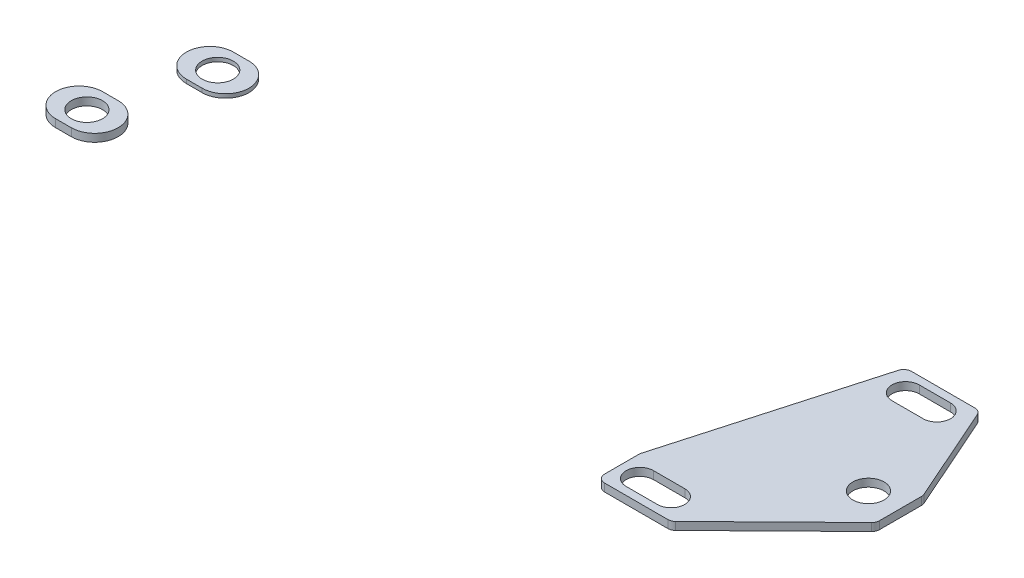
ISO-10303-21;
HEADER;
FILE_DESCRIPTION(('STEP AP214'),'2;1');
FILE_NAME('part.step','',(''),(''),'','','');
FILE_SCHEMA(('AUTOMOTIVE_DESIGN { 1 0 10303 214 1 1 1 1 }'));
ENDSEC;
DATA;
#1=APPLICATION_CONTEXT('core data for automotive mechanical design processes');
#2=APPLICATION_PROTOCOL_DEFINITION('international standard','automotive_design',2000,#1);
#3=PRODUCT_CONTEXT('',#1,'mechanical');
#4=PRODUCT('Part','Part','',(#3));
#5=PRODUCT_RELATED_PRODUCT_CATEGORY('part','',(#4));
#6=PRODUCT_DEFINITION_FORMATION('','',#4);
#7=PRODUCT_DEFINITION_CONTEXT('part definition',#1,'design');
#8=PRODUCT_DEFINITION('design','',#6,#7);
#9=PRODUCT_DEFINITION_SHAPE('','',#8);
#10=(LENGTH_UNIT() NAMED_UNIT(*) SI_UNIT(.MILLI.,.METRE.));
#11=(NAMED_UNIT(*) PLANE_ANGLE_UNIT() SI_UNIT($,.RADIAN.));
#12=(NAMED_UNIT(*) SI_UNIT($,.STERADIAN.) SOLID_ANGLE_UNIT());
#13=UNCERTAINTY_MEASURE_WITH_UNIT(LENGTH_MEASURE(1.E-05),#10,'distance_accuracy_value','');
#14=(GEOMETRIC_REPRESENTATION_CONTEXT(3) GLOBAL_UNCERTAINTY_ASSIGNED_CONTEXT((#13)) GLOBAL_UNIT_ASSIGNED_CONTEXT((#10,
#11,#12)) REPRESENTATION_CONTEXT('',''));
#15=CARTESIAN_POINT('',(0.,0.,0.));
#16=DIRECTION('',(0.,0.,1.));
#17=DIRECTION('',(1.,0.,0.));
#18=AXIS2_PLACEMENT_3D('',#15,#16,#17);
#19=CARTESIAN_POINT('',(0.,-10.,0.));
#20=DIRECTION('',(0.,-1.,0.));
#21=DIRECTION('',(0.,0.,-1.));
#22=AXIS2_PLACEMENT_3D('',#19,#20,#21);
#23=PLANE('',#22);
#24=CARTESIAN_POINT('',(83.,-10.,0.));
#25=DIRECTION('',(0.,-1.,0.));
#26=DIRECTION('',(0.,0.,-1.));
#27=AXIS2_PLACEMENT_3D('',#24,#25,#26);
#28=CIRCLE('',#27,4.00000000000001);
#29=CARTESIAN_POINT('',(83.,-10.,-4.00000000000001));
#30=VERTEX_POINT('',#29);
#31=EDGE_CURVE('E157',#30,#30,#28,.T.);
#32=ORIENTED_EDGE('',*,*,#31,.T.);
#33=EDGE_LOOP('',(#32));
#34=FACE_BOUND('',#33,.T.);
#35=DIRECTION('',(-0.713808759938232,0.,0.700340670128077));
#36=VECTOR('',#35,1.);
#37=CARTESIAN_POINT('',(47.632867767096,-10.,48.5488844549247));
#38=LINE('',#37,#36);
#39=CARTESIAN_POINT('',(90.4006813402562,-10.,6.58801076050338));
#40=VERTEX_POINT('',#39);
#41=CARTESIAN_POINT('',(65.0833898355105,-10.,31.4276175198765));
#42=VERTEX_POINT('',#41);
#43=EDGE_CURVE('E386',#40,#42,#38,.T.);
#44=ORIENTED_EDGE('',*,*,#43,.F.);
#45=CARTESIAN_POINT('',(89.,-10.,5.16039324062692));
#46=DIRECTION('',(0.,-1.,0.));
#47=DIRECTION('',(0.,0.,-1.));
#48=AXIS2_PLACEMENT_3D('',#45,#46,#47);
#49=CIRCLE('',#48,2.);
#50=CARTESIAN_POINT('',(91.,-10.,5.16039324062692));
#51=VERTEX_POINT('',#50);
#52=EDGE_CURVE('E469',#40,#51,#49,.F.);
#53=ORIENTED_EDGE('',*,*,#52,.T.);
#54=DIRECTION('',(0.,0.,1.));
#55=VECTOR('',#54,1.);
#56=CARTESIAN_POINT('',(91.,-10.,0.));
#57=LINE('',#56,#55);
#58=CARTESIAN_POINT('',(91.,-10.,-5.57743687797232));
#59=VERTEX_POINT('',#58);
#60=EDGE_CURVE('E534',#59,#51,#57,.T.);
#61=ORIENTED_EDGE('',*,*,#60,.F.);
#62=CARTESIAN_POINT('',(89.,-10.,-5.57743687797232));
#63=DIRECTION('',(0.,-1.,0.));
#64=DIRECTION('',(0.,0.,-1.));
#65=AXIS2_PLACEMENT_3D('',#62,#63,#64);
#66=CIRCLE('',#65,2.);
#67=CARTESIAN_POINT('',(90.8290706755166,-10.,-6.38644890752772));
#68=VERTEX_POINT('',#67);
#69=EDGE_CURVE('E467',#59,#68,#66,.F.);
#70=ORIENTED_EDGE('',*,*,#69,.T.);
#71=DIRECTION('',(-0.404506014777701,0.,-0.914535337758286));
#72=VECTOR('',#71,1.);
#73=CARTESIAN_POINT('',(78.3297247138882,-10.,-34.6458397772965));
#74=LINE('',#73,#72);
#75=CARTESIAN_POINT('',(80.0267831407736,-10.,-30.8090120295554));
#76=VERTEX_POINT('',#75);
#77=EDGE_CURVE('E502',#68,#76,#74,.T.);
#78=ORIENTED_EDGE('',*,*,#77,.T.);
#79=CARTESIAN_POINT('',(78.1977124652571,-10.,-30.));
#80=DIRECTION('',(0.,-1.,0.));
#81=DIRECTION('',(0.,0.,-1.));
#82=AXIS2_PLACEMENT_3D('',#79,#80,#81);
#83=CIRCLE('',#82,2.);
#84=CARTESIAN_POINT('',(78.1977124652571,-10.,-32.));
#85=VERTEX_POINT('',#84);
#86=EDGE_CURVE('E459',#76,#85,#83,.F.);
#87=ORIENTED_EDGE('',*,*,#86,.T.);
#88=DIRECTION('',(1.,0.,0.));
#89=VECTOR('',#88,1.);
#90=CARTESIAN_POINT('',(0.,-10.,-32.));
#91=LINE('',#90,#89);
#92=CARTESIAN_POINT('',(62.0125191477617,-10.,-32.));
#93=VERTEX_POINT('',#92);
#94=EDGE_CURVE('E495',#93,#85,#91,.T.);
#95=ORIENTED_EDGE('',*,*,#94,.F.);
#96=CARTESIAN_POINT('',(62.0125191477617,-10.,-30.));
#97=DIRECTION('',(0.,-1.,0.));
#98=DIRECTION('',(0.,0.,-1.));
#99=AXIS2_PLACEMENT_3D('',#96,#97,#98);
#100=CIRCLE('',#99,2.);
#101=CARTESIAN_POINT('',(60.0881070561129,-10.,-30.5446449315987));
#102=VERTEX_POINT('',#101);
#103=EDGE_CURVE('E170',#93,#102,#100,.F.);
#104=ORIENTED_EDGE('',*,*,#103,.T.);
#105=DIRECTION('',(0.272322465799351,0.,-0.962206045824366));
#106=VECTOR('',#105,1.);
#107=CARTESIAN_POINT('',(47.6283783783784,-10.,13.4797297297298));
#108=LINE('',#107,#106);
#109=CARTESIAN_POINT('',(45.5755879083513,-10.,20.7329227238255));
#110=VERTEX_POINT('',#109);
#111=EDGE_CURVE('E369',#110,#102,#108,.T.);
#112=ORIENTED_EDGE('',*,*,#111,.F.);
#113=CARTESIAN_POINT('',(47.5,-10.,21.2775676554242));
#114=DIRECTION('',(0.,-1.,0.));
#115=DIRECTION('',(0.,0.,-1.));
#116=AXIS2_PLACEMENT_3D('',#113,#114,#115);
#117=CIRCLE('',#116,2.);
#118=CARTESIAN_POINT('',(45.5,-10.,21.2775676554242));
#119=VERTEX_POINT('',#118);
#120=EDGE_CURVE('E461',#110,#119,#117,.F.);
#121=ORIENTED_EDGE('',*,*,#120,.T.);
#122=DIRECTION('',(0.,0.,1.));
#123=VECTOR('',#122,1.);
#124=CARTESIAN_POINT('',(45.5,-10.,0.));
#125=LINE('',#124,#123);
#126=CARTESIAN_POINT('',(45.5,-10.,30.));
#127=VERTEX_POINT('',#126);
#128=EDGE_CURVE('E365',#119,#127,#125,.T.);
#129=ORIENTED_EDGE('',*,*,#128,.T.);
#130=CARTESIAN_POINT('',(47.5,-10.,30.));
#131=DIRECTION('',(0.,-1.,0.));
#132=DIRECTION('',(0.,0.,-1.));
#133=AXIS2_PLACEMENT_3D('',#130,#131,#132);
#134=CIRCLE('',#133,2.);
#135=CARTESIAN_POINT('',(47.5,-10.,32.));
#136=VERTEX_POINT('',#135);
#137=EDGE_CURVE('E463',#127,#136,#134,.F.);
#138=ORIENTED_EDGE('',*,*,#137,.T.);
#139=DIRECTION('',(-1.,0.,0.));
#140=VECTOR('',#139,1.);
#141=CARTESIAN_POINT('',(0.,-10.,32.));
#142=LINE('',#141,#140);
#143=CARTESIAN_POINT('',(63.6827084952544,-10.,32.));
#144=VERTEX_POINT('',#143);
#145=EDGE_CURVE('E381',#144,#136,#142,.T.);
#146=ORIENTED_EDGE('',*,*,#145,.F.);
#147=CARTESIAN_POINT('',(63.6827084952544,-10.,30.));
#148=DIRECTION('',(0.,-1.,0.));
#149=DIRECTION('',(0.,0.,-1.));
#150=AXIS2_PLACEMENT_3D('',#147,#148,#149);
#151=CIRCLE('',#150,2.);
#152=EDGE_CURVE('E465',#144,#42,#151,.F.);
#153=ORIENTED_EDGE('',*,*,#152,.T.);
#154=EDGE_LOOP('',(#44,#53,#61,#70,#78,#87,#95,#104,#112,#121,#129,#138,#146,#153));
#155=FACE_BOUND('',#154,.T.);
#156=CARTESIAN_POINT('',(51.,-10.,26.5));
#157=DIRECTION('',(0.,-1.,0.));
#158=DIRECTION('',(0.,0.,-1.));
#159=AXIS2_PLACEMENT_3D('',#156,#157,#158);
#160=CIRCLE('',#159,3.5);
#161=CARTESIAN_POINT('',(51.,-10.,30.));
#162=VERTEX_POINT('',#161);
#163=CARTESIAN_POINT('',(51.,-10.,23.));
#164=VERTEX_POINT('',#163);
#165=EDGE_CURVE('E385',#162,#164,#160,.T.);
#166=ORIENTED_EDGE('',*,*,#165,.T.);
#167=DIRECTION('',(1.,0.,0.));
#168=VECTOR('',#167,1.);
#169=CARTESIAN_POINT('',(0.,-10.,23.));
#170=LINE('',#169,#168);
#171=CARTESIAN_POINT('',(59.,-10.,23.));
#172=VERTEX_POINT('',#171);
#173=EDGE_CURVE('E408',#164,#172,#170,.T.);
#174=ORIENTED_EDGE('',*,*,#173,.T.);
#175=CARTESIAN_POINT('',(59.,-10.,26.5));
#176=DIRECTION('',(0.,-1.,0.));
#177=DIRECTION('',(0.,0.,-1.));
#178=AXIS2_PLACEMENT_3D('',#175,#176,#177);
#179=CIRCLE('',#178,3.5);
#180=CARTESIAN_POINT('',(59.,-10.,30.));
#181=VERTEX_POINT('',#180);
#182=EDGE_CURVE('E396',#172,#181,#179,.T.);
#183=ORIENTED_EDGE('',*,*,#182,.T.);
#184=DIRECTION('',(-1.,0.,0.));
#185=VECTOR('',#184,1.);
#186=CARTESIAN_POINT('',(0.,-10.,30.));
#187=LINE('',#186,#185);
#188=EDGE_CURVE('E392',#181,#162,#187,.T.);
#189=ORIENTED_EDGE('',*,*,#188,.T.);
#190=EDGE_LOOP('',(#166,#174,#183,#189));
#191=FACE_BOUND('',#190,.T.);
#192=DIRECTION('',(-1.,0.,0.));
#193=VECTOR('',#192,1.);
#194=CARTESIAN_POINT('',(0.,-10.,-30.));
#195=LINE('',#194,#193);
#196=CARTESIAN_POINT('',(74.,-10.,-30.));
#197=VERTEX_POINT('',#196);
#198=CARTESIAN_POINT('',(66.,-10.,-30.));
#199=VERTEX_POINT('',#198);
#200=EDGE_CURVE('E404',#197,#199,#195,.T.);
#201=ORIENTED_EDGE('',*,*,#200,.F.);
#202=CARTESIAN_POINT('',(74.,-10.,-26.5));
#203=DIRECTION('',(0.,-1.,0.));
#204=DIRECTION('',(0.,0.,-1.));
#205=AXIS2_PLACEMENT_3D('',#202,#203,#204);
#206=CIRCLE('',#205,3.5);
#207=CARTESIAN_POINT('',(74.,-10.,-23.));
#208=VERTEX_POINT('',#207);
#209=EDGE_CURVE('E314',#197,#208,#206,.T.);
#210=ORIENTED_EDGE('',*,*,#209,.T.);
#211=DIRECTION('',(-1.,0.,0.));
#212=VECTOR('',#211,1.);
#213=CARTESIAN_POINT('',(0.,-10.,-23.));
#214=LINE('',#213,#212);
#215=CARTESIAN_POINT('',(66.,-10.,-23.));
#216=VERTEX_POINT('',#215);
#217=EDGE_CURVE('E410',#208,#216,#214,.T.);
#218=ORIENTED_EDGE('',*,*,#217,.T.);
#219=CARTESIAN_POINT('',(66.,-10.,-26.5));
#220=DIRECTION('',(0.,-1.,0.));
#221=DIRECTION('',(0.,0.,-1.));
#222=AXIS2_PLACEMENT_3D('',#219,#220,#221);
#223=CIRCLE('',#222,3.5);
#224=EDGE_CURVE('E407',#199,#216,#223,.F.);
#225=ORIENTED_EDGE('',*,*,#224,.F.);
#226=EDGE_LOOP('',(#201,#210,#218,#225));
#227=FACE_BOUND('',#226,.T.);
#228=ADVANCED_FACE('F153',(#34,#155,#191,#227),#23,.F.);
#229=CARTESIAN_POINT('',(89.,-10.,5.16039324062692));
#230=DIRECTION('',(0.,-1.,0.));
#231=DIRECTION('',(0.,0.,-1.));
#232=AXIS2_PLACEMENT_3D('',#229,#230,#231);
#233=CYLINDRICAL_SURFACE('',#232,2.);
#234=ORIENTED_EDGE('',*,*,#52,.F.);
#235=DIRECTION('',(0.,-1.,0.));
#236=VECTOR('',#235,1.);
#237=CARTESIAN_POINT('',(90.4006813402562,-10.,6.58801076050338));
#238=LINE('',#237,#236);
#239=CARTESIAN_POINT('',(90.4006813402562,-12.,6.58801076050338));
#240=VERTEX_POINT('',#239);
#241=EDGE_CURVE('E456',#240,#40,#238,.F.);
#242=ORIENTED_EDGE('',*,*,#241,.F.);
#243=CARTESIAN_POINT('',(89.,-12.,5.16039324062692));
#244=DIRECTION('',(0.,-1.,0.));
#245=DIRECTION('',(0.,0.,-1.));
#246=AXIS2_PLACEMENT_3D('',#243,#244,#245);
#247=CIRCLE('',#246,2.);
#248=CARTESIAN_POINT('',(91.,-12.,5.16039324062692));
#249=VERTEX_POINT('',#248);
#250=EDGE_CURVE('E451',#249,#240,#247,.T.);
#251=ORIENTED_EDGE('',*,*,#250,.F.);
#252=DIRECTION('',(0.,-1.,0.));
#253=VECTOR('',#252,1.);
#254=CARTESIAN_POINT('',(91.,-10.,5.16039324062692));
#255=LINE('',#254,#253);
#256=EDGE_CURVE('E436',#51,#249,#255,.T.);
#257=ORIENTED_EDGE('',*,*,#256,.F.);
#258=EDGE_LOOP('',(#234,#242,#251,#257));
#259=FACE_BOUND('',#258,.T.);
#260=ADVANCED_FACE('F562',(#259),#233,.T.);
#261=CARTESIAN_POINT('',(91.,-10.,0.));
#262=DIRECTION('',(1.,0.,0.));
#263=DIRECTION('',(0.,0.,-1.));
#264=AXIS2_PLACEMENT_3D('',#261,#262,#263);
#265=PLANE('',#264);
#266=ORIENTED_EDGE('',*,*,#60,.T.);
#267=ORIENTED_EDGE('',*,*,#256,.T.);
#268=DIRECTION('',(0.,0.,1.));
#269=VECTOR('',#268,1.);
#270=CARTESIAN_POINT('',(91.,-12.,0.));
#271=LINE('',#270,#269);
#272=CARTESIAN_POINT('',(91.,-12.,-5.57743687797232));
#273=VERTEX_POINT('',#272);
#274=EDGE_CURVE('E427',#273,#249,#271,.T.);
#275=ORIENTED_EDGE('',*,*,#274,.F.);
#276=DIRECTION('',(0.,-1.,0.));
#277=VECTOR('',#276,1.);
#278=CARTESIAN_POINT('',(91.,-10.,-5.57743687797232));
#279=LINE('',#278,#277);
#280=EDGE_CURVE('E415',#273,#59,#279,.F.);
#281=ORIENTED_EDGE('',*,*,#280,.T.);
#282=EDGE_LOOP('',(#266,#267,#275,#281));
#283=FACE_BOUND('',#282,.T.);
#284=ADVANCED_FACE('F560',(#283),#265,.T.);
#285=CARTESIAN_POINT('',(89.,-10.,-5.57743687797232));
#286=DIRECTION('',(0.,1.,0.));
#287=DIRECTION('',(0.,0.,1.));
#288=AXIS2_PLACEMENT_3D('',#285,#286,#287);
#289=CYLINDRICAL_SURFACE('',#288,2.);
#290=ORIENTED_EDGE('',*,*,#69,.F.);
#291=ORIENTED_EDGE('',*,*,#280,.F.);
#292=CARTESIAN_POINT('',(89.,-12.,-5.57743687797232));
#293=DIRECTION('',(0.,-1.,0.));
#294=DIRECTION('',(0.,0.,-1.));
#295=AXIS2_PLACEMENT_3D('',#292,#293,#294);
#296=CIRCLE('',#295,2.);
#297=CARTESIAN_POINT('',(90.8290706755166,-12.,-6.38644890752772));
#298=VERTEX_POINT('',#297);
#299=EDGE_CURVE('E449',#298,#273,#296,.T.);
#300=ORIENTED_EDGE('',*,*,#299,.F.);
#301=DIRECTION('',(0.,-1.,0.));
#302=VECTOR('',#301,1.);
#303=CARTESIAN_POINT('',(90.8290706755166,-12.,-6.38644890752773));
#304=LINE('',#303,#302);
#305=EDGE_CURVE('E473',#68,#298,#304,.T.);
#306=ORIENTED_EDGE('',*,*,#305,.F.);
#307=EDGE_LOOP('',(#290,#291,#300,#306));
#308=FACE_BOUND('',#307,.T.);
#309=ADVANCED_FACE('F557',(#308),#289,.T.);
#310=CARTESIAN_POINT('',(78.3297247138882,-10.,-34.6458397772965));
#311=DIRECTION('',(-0.914535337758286,0.,0.404506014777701));
#312=DIRECTION('',(0.404506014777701,0.,0.914535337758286));
#313=AXIS2_PLACEMENT_3D('',#310,#311,#312);
#314=PLANE('',#313);
#315=ORIENTED_EDGE('',*,*,#77,.F.);
#316=ORIENTED_EDGE('',*,*,#305,.T.);
#317=DIRECTION('',(-0.404506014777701,0.,-0.914535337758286));
#318=VECTOR('',#317,1.);
#319=CARTESIAN_POINT('',(78.3297247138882,-12.,-34.6458397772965));
#320=LINE('',#319,#318);
#321=CARTESIAN_POINT('',(80.0267831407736,-12.,-30.8090120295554));
#322=VERTEX_POINT('',#321);
#323=EDGE_CURVE('E424',#298,#322,#320,.T.);
#324=ORIENTED_EDGE('',*,*,#323,.T.);
#325=DIRECTION('',(0.,-1.,0.));
#326=VECTOR('',#325,1.);
#327=CARTESIAN_POINT('',(80.0267831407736,-10.,-30.8090120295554));
#328=LINE('',#327,#326);
#329=EDGE_CURVE('E471',#322,#76,#328,.F.);
#330=ORIENTED_EDGE('',*,*,#329,.T.);
#331=EDGE_LOOP('',(#315,#316,#324,#330));
#332=FACE_BOUND('',#331,.T.);
#333=ADVANCED_FACE('F555',(#332),#314,.F.);
#334=CARTESIAN_POINT('',(78.1977124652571,-10.,-30.));
#335=DIRECTION('',(0.,1.,0.));
#336=DIRECTION('',(0.,0.,1.));
#337=AXIS2_PLACEMENT_3D('',#334,#335,#336);
#338=CYLINDRICAL_SURFACE('',#337,2.);
#339=ORIENTED_EDGE('',*,*,#86,.F.);
#340=ORIENTED_EDGE('',*,*,#329,.F.);
#341=CARTESIAN_POINT('',(78.1977124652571,-12.,-30.));
#342=DIRECTION('',(0.,-1.,0.));
#343=DIRECTION('',(0.,0.,-1.));
#344=AXIS2_PLACEMENT_3D('',#341,#342,#343);
#345=CIRCLE('',#344,2.);
#346=CARTESIAN_POINT('',(78.1977124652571,-12.,-32.));
#347=VERTEX_POINT('',#346);
#348=EDGE_CURVE('E441',#347,#322,#345,.T.);
#349=ORIENTED_EDGE('',*,*,#348,.F.);
#350=DIRECTION('',(0.,-1.,0.));
#351=VECTOR('',#350,1.);
#352=CARTESIAN_POINT('',(78.1977124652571,-12.,-32.));
#353=LINE('',#352,#351);
#354=EDGE_CURVE('E14',#85,#347,#353,.T.);
#355=ORIENTED_EDGE('',*,*,#354,.F.);
#356=EDGE_LOOP('',(#339,#340,#349,#355));
#357=FACE_BOUND('',#356,.T.);
#358=ADVANCED_FACE('F553',(#357),#338,.T.);
#359=CARTESIAN_POINT('',(0.,-10.,-32.));
#360=DIRECTION('',(0.,0.,-1.));
#361=DIRECTION('',(-1.,0.,0.));
#362=AXIS2_PLACEMENT_3D('',#359,#360,#361);
#363=PLANE('',#362);
#364=ORIENTED_EDGE('',*,*,#94,.T.);
#365=ORIENTED_EDGE('',*,*,#354,.T.);
#366=DIRECTION('',(1.,0.,0.));
#367=VECTOR('',#366,1.);
#368=CARTESIAN_POINT('',(0.,-12.,-32.));
#369=LINE('',#368,#367);
#370=CARTESIAN_POINT('',(62.0125191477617,-12.,-32.));
#371=VERTEX_POINT('',#370);
#372=EDGE_CURVE('E421',#371,#347,#369,.T.);
#373=ORIENTED_EDGE('',*,*,#372,.F.);
#374=DIRECTION('',(0.,-1.,0.));
#375=VECTOR('',#374,1.);
#376=CARTESIAN_POINT('',(62.0125191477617,-10.,-32.));
#377=LINE('',#376,#375);
#378=EDGE_CURVE('E163',#371,#93,#377,.F.);
#379=ORIENTED_EDGE('',*,*,#378,.T.);
#380=EDGE_LOOP('',(#364,#365,#373,#379));
#381=FACE_BOUND('',#380,.T.);
#382=ADVANCED_FACE('F494',(#381),#363,.T.);
#383=CARTESIAN_POINT('',(62.0125191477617,-10.,-30.));
#384=DIRECTION('',(0.,-1.,0.));
#385=DIRECTION('',(0.,0.,-1.));
#386=AXIS2_PLACEMENT_3D('',#383,#384,#385);
#387=CYLINDRICAL_SURFACE('',#386,2.);
#388=ORIENTED_EDGE('',*,*,#103,.F.);
#389=ORIENTED_EDGE('',*,*,#378,.F.);
#390=CARTESIAN_POINT('',(62.0125191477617,-12.,-30.));
#391=DIRECTION('',(0.,-1.,0.));
#392=DIRECTION('',(0.,0.,-1.));
#393=AXIS2_PLACEMENT_3D('',#390,#391,#392);
#394=CIRCLE('',#393,2.);
#395=CARTESIAN_POINT('',(60.0881070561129,-12.,-30.5446449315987));
#396=VERTEX_POINT('',#395);
#397=EDGE_CURVE('E439',#396,#371,#394,.T.);
#398=ORIENTED_EDGE('',*,*,#397,.F.);
#399=DIRECTION('',(0.,-1.,0.));
#400=VECTOR('',#399,1.);
#401=CARTESIAN_POINT('',(60.0881070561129,-10.,-30.5446449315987));
#402=LINE('',#401,#400);
#403=EDGE_CURVE('E486',#102,#396,#402,.T.);
#404=ORIENTED_EDGE('',*,*,#403,.F.);
#405=EDGE_LOOP('',(#388,#389,#398,#404));
#406=FACE_BOUND('',#405,.T.);
#407=ADVANCED_FACE('F155',(#406),#387,.T.);
#408=CARTESIAN_POINT('',(47.6283783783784,-10.,13.4797297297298));
#409=DIRECTION('',(-0.962206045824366,0.,-0.272322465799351));
#410=DIRECTION('',(-0.272322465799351,0.,0.962206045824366));
#411=AXIS2_PLACEMENT_3D('',#408,#409,#410);
#412=PLANE('',#411);
#413=DIRECTION('',(0.272322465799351,0.,-0.962206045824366));
#414=VECTOR('',#413,1.);
#415=CARTESIAN_POINT('',(47.6283783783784,-12.,13.4797297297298));
#416=LINE('',#415,#414);
#417=CARTESIAN_POINT('',(45.5755879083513,-12.,20.7329227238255));
#418=VERTEX_POINT('',#417);
#419=EDGE_CURVE('E418',#418,#396,#416,.T.);
#420=ORIENTED_EDGE('',*,*,#419,.F.);
#421=DIRECTION('',(0.,-1.,0.));
#422=VECTOR('',#421,1.);
#423=CARTESIAN_POINT('',(45.5755879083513,-10.,20.7329227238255));
#424=LINE('',#423,#422);
#425=EDGE_CURVE('E177',#418,#110,#424,.F.);
#426=ORIENTED_EDGE('',*,*,#425,.T.);
#427=ORIENTED_EDGE('',*,*,#111,.T.);
#428=ORIENTED_EDGE('',*,*,#403,.T.);
#429=EDGE_LOOP('',(#420,#426,#427,#428));
#430=FACE_BOUND('',#429,.T.);
#431=ADVANCED_FACE('F504',(#430),#412,.T.);
#432=CARTESIAN_POINT('',(47.5,-10.,21.2775676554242));
#433=DIRECTION('',(0.,1.,0.));
#434=DIRECTION('',(0.,0.,1.));
#435=AXIS2_PLACEMENT_3D('',#432,#433,#434);
#436=CYLINDRICAL_SURFACE('',#435,2.);
#437=ORIENTED_EDGE('',*,*,#120,.F.);
#438=ORIENTED_EDGE('',*,*,#425,.F.);
#439=CARTESIAN_POINT('',(47.5,-12.,21.2775676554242));
#440=DIRECTION('',(0.,-1.,0.));
#441=DIRECTION('',(0.,0.,-1.));
#442=AXIS2_PLACEMENT_3D('',#439,#440,#441);
#443=CIRCLE('',#442,2.);
#444=CARTESIAN_POINT('',(45.5,-12.,21.2775676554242));
#445=VERTEX_POINT('',#444);
#446=EDGE_CURVE('E443',#445,#418,#443,.T.);
#447=ORIENTED_EDGE('',*,*,#446,.F.);
#448=DIRECTION('',(0.,-1.,0.));
#449=VECTOR('',#448,1.);
#450=CARTESIAN_POINT('',(45.5,-12.,21.2775676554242));
#451=LINE('',#450,#449);
#452=EDGE_CURVE('E481',#119,#445,#451,.T.);
#453=ORIENTED_EDGE('',*,*,#452,.F.);
#454=EDGE_LOOP('',(#437,#438,#447,#453));
#455=FACE_BOUND('',#454,.T.);
#456=ADVANCED_FACE('F510',(#455),#436,.T.);
#457=CARTESIAN_POINT('',(45.5,-10.,0.));
#458=DIRECTION('',(1.,0.,0.));
#459=DIRECTION('',(0.,0.,-1.));
#460=AXIS2_PLACEMENT_3D('',#457,#458,#459);
#461=PLANE('',#460);
#462=DIRECTION('',(0.,0.,1.));
#463=VECTOR('',#462,1.);
#464=CARTESIAN_POINT('',(45.5,-12.,0.));
#465=LINE('',#464,#463);
#466=CARTESIAN_POINT('',(45.5,-12.,30.));
#467=VERTEX_POINT('',#466);
#468=EDGE_CURVE('E344',#445,#467,#465,.T.);
#469=ORIENTED_EDGE('',*,*,#468,.T.);
#470=DIRECTION('',(0.,-1.,0.));
#471=VECTOR('',#470,1.);
#472=CARTESIAN_POINT('',(45.5,-10.,30.));
#473=LINE('',#472,#471);
#474=EDGE_CURVE('E484',#467,#127,#473,.F.);
#475=ORIENTED_EDGE('',*,*,#474,.T.);
#476=ORIENTED_EDGE('',*,*,#128,.F.);
#477=ORIENTED_EDGE('',*,*,#452,.T.);
#478=EDGE_LOOP('',(#469,#475,#476,#477));
#479=FACE_BOUND('',#478,.T.);
#480=ADVANCED_FACE('F513',(#479),#461,.F.);
#481=CARTESIAN_POINT('',(47.5,-10.,30.));
#482=DIRECTION('',(0.,1.,0.));
#483=DIRECTION('',(0.,0.,1.));
#484=AXIS2_PLACEMENT_3D('',#481,#482,#483);
#485=CYLINDRICAL_SURFACE('',#484,2.);
#486=ORIENTED_EDGE('',*,*,#137,.F.);
#487=ORIENTED_EDGE('',*,*,#474,.F.);
#488=CARTESIAN_POINT('',(47.5,-12.,30.));
#489=DIRECTION('',(0.,-1.,0.));
#490=DIRECTION('',(0.,0.,-1.));
#491=AXIS2_PLACEMENT_3D('',#488,#489,#490);
#492=CIRCLE('',#491,2.);
#493=CARTESIAN_POINT('',(47.5,-12.,32.));
#494=VERTEX_POINT('',#493);
#495=EDGE_CURVE('E445',#494,#467,#492,.T.);
#496=ORIENTED_EDGE('',*,*,#495,.F.);
#497=DIRECTION('',(0.,-1.,0.));
#498=VECTOR('',#497,1.);
#499=CARTESIAN_POINT('',(47.5,-12.,32.));
#500=LINE('',#499,#498);
#501=EDGE_CURVE('E476',#136,#494,#500,.T.);
#502=ORIENTED_EDGE('',*,*,#501,.F.);
#503=EDGE_LOOP('',(#486,#487,#496,#502));
#504=FACE_BOUND('',#503,.T.);
#505=ADVANCED_FACE('F519',(#504),#485,.T.);
#506=CARTESIAN_POINT('',(47.632867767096,-10.,48.5488844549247));
#507=DIRECTION('',(0.700340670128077,0.,0.713808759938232));
#508=DIRECTION('',(0.713808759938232,0.,-0.700340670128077));
#509=AXIS2_PLACEMENT_3D('',#506,#507,#508);
#510=PLANE('',#509);
#511=DIRECTION('',(-0.713808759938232,0.,0.700340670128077));
#512=VECTOR('',#511,1.);
#513=CARTESIAN_POINT('',(47.632867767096,-12.,48.5488844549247));
#514=LINE('',#513,#512);
#515=CARTESIAN_POINT('',(65.0833898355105,-12.,31.4276175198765));
#516=VERTEX_POINT('',#515);
#517=EDGE_CURVE('E430',#240,#516,#514,.T.);
#518=ORIENTED_EDGE('',*,*,#517,.F.);
#519=ORIENTED_EDGE('',*,*,#241,.T.);
#520=ORIENTED_EDGE('',*,*,#43,.T.);
#521=DIRECTION('',(0.,-1.,0.));
#522=VECTOR('',#521,1.);
#523=CARTESIAN_POINT('',(65.0833898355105,-10.,31.4276175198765));
#524=LINE('',#523,#522);
#525=EDGE_CURVE('E453',#42,#516,#524,.T.);
#526=ORIENTED_EDGE('',*,*,#525,.T.);
#527=EDGE_LOOP('',(#518,#519,#520,#526));
#528=FACE_BOUND('',#527,.T.);
#529=ADVANCED_FACE('F531',(#528),#510,.T.);
#530=CARTESIAN_POINT('',(0.,-12.,23.));
#531=DIRECTION('',(0.,0.,1.));
#532=DIRECTION('',(1.,0.,0.));
#533=AXIS2_PLACEMENT_3D('',#530,#531,#532);
#534=PLANE('',#533);
#535=ORIENTED_EDGE('',*,*,#173,.F.);
#536=DIRECTION('',(0.,1.,0.));
#537=VECTOR('',#536,1.);
#538=CARTESIAN_POINT('',(51.,-12.,23.));
#539=LINE('',#538,#537);
#540=CARTESIAN_POINT('',(51.,-12.,23.));
#541=VERTEX_POINT('',#540);
#542=EDGE_CURVE('E361',#541,#164,#539,.T.);
#543=ORIENTED_EDGE('',*,*,#542,.F.);
#544=DIRECTION('',(1.,0.,0.));
#545=VECTOR('',#544,1.);
#546=CARTESIAN_POINT('',(0.,-12.,23.));
#547=LINE('',#546,#545);
#548=CARTESIAN_POINT('',(59.,-12.,23.));
#549=VERTEX_POINT('',#548);
#550=EDGE_CURVE('E351',#541,#549,#547,.T.);
#551=ORIENTED_EDGE('',*,*,#550,.T.);
#552=DIRECTION('',(0.,1.,0.));
#553=VECTOR('',#552,1.);
#554=CARTESIAN_POINT('',(59.,-12.,23.));
#555=LINE('',#554,#553);
#556=EDGE_CURVE('E357',#549,#172,#555,.T.);
#557=ORIENTED_EDGE('',*,*,#556,.T.);
#558=EDGE_LOOP('',(#535,#543,#551,#557));
#559=FACE_BOUND('',#558,.T.);
#560=ADVANCED_FACE('F610',(#559),#534,.T.);
#561=CARTESIAN_POINT('',(51.,-12.,26.5));
#562=DIRECTION('',(0.,1.,0.));
#563=DIRECTION('',(0.,0.,1.));
#564=AXIS2_PLACEMENT_3D('',#561,#562,#563);
#565=CYLINDRICAL_SURFACE('',#564,3.5);
#566=DIRECTION('',(0.,1.,0.));
#567=VECTOR('',#566,1.);
#568=CARTESIAN_POINT('',(51.,-12.,30.));
#569=LINE('',#568,#567);
#570=CARTESIAN_POINT('',(51.,-12.,30.));
#571=VERTEX_POINT('',#570);
#572=EDGE_CURVE('E335',#571,#162,#569,.T.);
#573=ORIENTED_EDGE('',*,*,#572,.F.);
#574=CARTESIAN_POINT('',(51.,-12.,26.5));
#575=DIRECTION('',(0.,1.,0.));
#576=DIRECTION('',(0.,0.,1.));
#577=AXIS2_PLACEMENT_3D('',#574,#575,#576);
#578=CIRCLE('',#577,3.5);
#579=EDGE_CURVE('E353',#541,#571,#578,.T.);
#580=ORIENTED_EDGE('',*,*,#579,.F.);
#581=ORIENTED_EDGE('',*,*,#542,.T.);
#582=ORIENTED_EDGE('',*,*,#165,.F.);
#583=EDGE_LOOP('',(#573,#580,#581,#582));
#584=FACE_BOUND('',#583,.T.);
#585=ADVANCED_FACE('F616',(#584),#565,.F.);
#586=CARTESIAN_POINT('',(74.,-12.,-26.5));
#587=DIRECTION('',(0.,1.,0.));
#588=DIRECTION('',(0.,0.,1.));
#589=AXIS2_PLACEMENT_3D('',#586,#587,#588);
#590=CYLINDRICAL_SURFACE('',#589,3.5);
#591=DIRECTION('',(0.,1.,0.));
#592=VECTOR('',#591,1.);
#593=CARTESIAN_POINT('',(74.,-12.,-30.));
#594=LINE('',#593,#592);
#595=CARTESIAN_POINT('',(74.,-12.,-30.));
#596=VERTEX_POINT('',#595);
#597=EDGE_CURVE('E306',#596,#197,#594,.T.);
#598=ORIENTED_EDGE('',*,*,#597,.F.);
#599=CARTESIAN_POINT('',(74.,-12.,-26.5));
#600=DIRECTION('',(0.,1.,0.));
#601=DIRECTION('',(0.,0.,1.));
#602=AXIS2_PLACEMENT_3D('',#599,#600,#601);
#603=CIRCLE('',#602,3.5);
#604=CARTESIAN_POINT('',(74.,-12.,-23.));
#605=VERTEX_POINT('',#604);
#606=EDGE_CURVE('E311',#605,#596,#603,.T.);
#607=ORIENTED_EDGE('',*,*,#606,.F.);
#608=DIRECTION('',(0.,1.,0.));
#609=VECTOR('',#608,1.);
#610=CARTESIAN_POINT('',(74.,-12.,-23.));
#611=LINE('',#610,#609);
#612=EDGE_CURVE('E342',#605,#208,#611,.T.);
#613=ORIENTED_EDGE('',*,*,#612,.T.);
#614=ORIENTED_EDGE('',*,*,#209,.F.);
#615=EDGE_LOOP('',(#598,#607,#613,#614));
#616=FACE_BOUND('',#615,.T.);
#617=ADVANCED_FACE('F308',(#616),#590,.F.);
#618=CARTESIAN_POINT('',(0.,-12.,-30.));
#619=DIRECTION('',(0.,0.,-1.));
#620=DIRECTION('',(-1.,0.,0.));
#621=AXIS2_PLACEMENT_3D('',#618,#619,#620);
#622=PLANE('',#621);
#623=DIRECTION('',(0.,1.,0.));
#624=VECTOR('',#623,1.);
#625=CARTESIAN_POINT('',(66.,-12.,-30.));
#626=LINE('',#625,#624);
#627=CARTESIAN_POINT('',(66.,-12.,-30.));
#628=VERTEX_POINT('',#627);
#629=EDGE_CURVE('E317',#628,#199,#626,.T.);
#630=ORIENTED_EDGE('',*,*,#629,.F.);
#631=DIRECTION('',(-1.,0.,0.));
#632=VECTOR('',#631,1.);
#633=CARTESIAN_POINT('',(0.,-12.,-30.));
#634=LINE('',#633,#632);
#635=EDGE_CURVE('E322',#596,#628,#634,.T.);
#636=ORIENTED_EDGE('',*,*,#635,.F.);
#637=ORIENTED_EDGE('',*,*,#597,.T.);
#638=ORIENTED_EDGE('',*,*,#200,.T.);
#639=EDGE_LOOP('',(#630,#636,#637,#638));
#640=FACE_BOUND('',#639,.T.);
#641=ADVANCED_FACE('F323',(#640),#622,.F.);
#642=CARTESIAN_POINT('',(0.,-12.,0.));
#643=DIRECTION('',(0.,-1.,0.));
#644=DIRECTION('',(0.,0.,-1.));
#645=AXIS2_PLACEMENT_3D('',#642,#643,#644);
#646=PLANE('',#645);
#647=CARTESIAN_POINT('',(83.,-12.,0.));
#648=DIRECTION('',(0.,1.,0.));
#649=DIRECTION('',(0.,0.,1.));
#650=AXIS2_PLACEMENT_3D('',#647,#648,#649);
#651=CIRCLE('',#650,4.00000000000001);
#652=CARTESIAN_POINT('',(83.,-12.,4.00000000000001));
#653=VERTEX_POINT('',#652);
#654=EDGE_CURVE('E338',#653,#653,#651,.T.);
#655=ORIENTED_EDGE('',*,*,#654,.T.);
#656=EDGE_LOOP('',(#655));
#657=FACE_BOUND('',#656,.T.);
#658=ORIENTED_EDGE('',*,*,#606,.T.);
#659=ORIENTED_EDGE('',*,*,#635,.T.);
#660=CARTESIAN_POINT('',(66.,-12.,-26.5));
#661=DIRECTION('',(0.,1.,0.));
#662=DIRECTION('',(0.,0.,1.));
#663=AXIS2_PLACEMENT_3D('',#660,#661,#662);
#664=CIRCLE('',#663,3.5);
#665=CARTESIAN_POINT('',(66.,-12.,-23.));
#666=VERTEX_POINT('',#665);
#667=EDGE_CURVE('E327',#628,#666,#664,.T.);
#668=ORIENTED_EDGE('',*,*,#667,.T.);
#669=DIRECTION('',(1.,0.,0.));
#670=VECTOR('',#669,1.);
#671=CARTESIAN_POINT('',(0.,-12.,-23.));
#672=LINE('',#671,#670);
#673=EDGE_CURVE('E318',#666,#605,#672,.T.);
#674=ORIENTED_EDGE('',*,*,#673,.T.);
#675=EDGE_LOOP('',(#658,#659,#668,#674));
#676=FACE_BOUND('',#675,.T.);
#677=ORIENTED_EDGE('',*,*,#274,.T.);
#678=ORIENTED_EDGE('',*,*,#250,.T.);
#679=ORIENTED_EDGE('',*,*,#517,.T.);
#680=CARTESIAN_POINT('',(63.6827084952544,-12.,30.));
#681=DIRECTION('',(0.,-1.,0.));
#682=DIRECTION('',(0.,0.,-1.));
#683=AXIS2_PLACEMENT_3D('',#680,#681,#682);
#684=CIRCLE('',#683,2.);
#685=CARTESIAN_POINT('',(63.6827084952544,-12.,32.));
#686=VERTEX_POINT('',#685);
#687=EDGE_CURVE('E447',#516,#686,#684,.T.);
#688=ORIENTED_EDGE('',*,*,#687,.T.);
#689=DIRECTION('',(-1.,0.,0.));
#690=VECTOR('',#689,1.);
#691=CARTESIAN_POINT('',(0.,-12.,32.));
#692=LINE('',#691,#690);
#693=EDGE_CURVE('E370',#686,#494,#692,.T.);
#694=ORIENTED_EDGE('',*,*,#693,.T.);
#695=ORIENTED_EDGE('',*,*,#495,.T.);
#696=ORIENTED_EDGE('',*,*,#468,.F.);
#697=ORIENTED_EDGE('',*,*,#446,.T.);
#698=ORIENTED_EDGE('',*,*,#419,.T.);
#699=ORIENTED_EDGE('',*,*,#397,.T.);
#700=ORIENTED_EDGE('',*,*,#372,.T.);
#701=ORIENTED_EDGE('',*,*,#348,.T.);
#702=ORIENTED_EDGE('',*,*,#323,.F.);
#703=ORIENTED_EDGE('',*,*,#299,.T.);
#704=EDGE_LOOP('',(#677,#678,#679,#688,#694,#695,#696,#697,#698,#699,#700,#701,#702,#703));
#705=FACE_BOUND('',#704,.T.);
#706=DIRECTION('',(-1.,0.,0.));
#707=VECTOR('',#706,1.);
#708=CARTESIAN_POINT('',(0.,-12.,30.));
#709=LINE('',#708,#707);
#710=CARTESIAN_POINT('',(59.,-12.,30.));
#711=VERTEX_POINT('',#710);
#712=EDGE_CURVE('E356',#711,#571,#709,.T.);
#713=ORIENTED_EDGE('',*,*,#712,.F.);
#714=CARTESIAN_POINT('',(59.,-12.,26.5));
#715=DIRECTION('',(0.,1.,0.));
#716=DIRECTION('',(0.,0.,1.));
#717=AXIS2_PLACEMENT_3D('',#714,#715,#716);
#718=CIRCLE('',#717,3.5);
#719=EDGE_CURVE('E349',#549,#711,#718,.F.);
#720=ORIENTED_EDGE('',*,*,#719,.F.);
#721=ORIENTED_EDGE('',*,*,#550,.F.);
#722=ORIENTED_EDGE('',*,*,#579,.T.);
#723=EDGE_LOOP('',(#713,#720,#721,#722));
#724=FACE_BOUND('',#723,.T.);
#725=ADVANCED_FACE('F329',(#657,#676,#705,#724),#646,.T.);
#726=CARTESIAN_POINT('',(0.,-12.,-23.));
#727=DIRECTION('',(0.,0.,1.));
#728=DIRECTION('',(1.,0.,0.));
#729=AXIS2_PLACEMENT_3D('',#726,#727,#728);
#730=PLANE('',#729);
#731=ORIENTED_EDGE('',*,*,#612,.F.);
#732=ORIENTED_EDGE('',*,*,#673,.F.);
#733=DIRECTION('',(0.,1.,0.));
#734=VECTOR('',#733,1.);
#735=CARTESIAN_POINT('',(66.,-12.,-23.));
#736=LINE('',#735,#734);
#737=EDGE_CURVE('E345',#666,#216,#736,.T.);
#738=ORIENTED_EDGE('',*,*,#737,.T.);
#739=ORIENTED_EDGE('',*,*,#217,.F.);
#740=EDGE_LOOP('',(#731,#732,#738,#739));
#741=FACE_BOUND('',#740,.T.);
#742=ADVANCED_FACE('F644',(#741),#730,.F.);
#743=CARTESIAN_POINT('',(66.,-12.,-26.5));
#744=DIRECTION('',(0.,1.,0.));
#745=DIRECTION('',(0.,0.,1.));
#746=AXIS2_PLACEMENT_3D('',#743,#744,#745);
#747=CYLINDRICAL_SURFACE('',#746,3.5);
#748=ORIENTED_EDGE('',*,*,#737,.F.);
#749=ORIENTED_EDGE('',*,*,#667,.F.);
#750=ORIENTED_EDGE('',*,*,#629,.T.);
#751=ORIENTED_EDGE('',*,*,#224,.T.);
#752=EDGE_LOOP('',(#748,#749,#750,#751));
#753=FACE_BOUND('',#752,.T.);
#754=ADVANCED_FACE('F651',(#753),#747,.F.);
#755=CARTESIAN_POINT('',(59.,-12.,26.5));
#756=DIRECTION('',(0.,1.,0.));
#757=DIRECTION('',(0.,0.,1.));
#758=AXIS2_PLACEMENT_3D('',#755,#756,#757);
#759=CYLINDRICAL_SURFACE('',#758,3.5);
#760=ORIENTED_EDGE('',*,*,#182,.F.);
#761=ORIENTED_EDGE('',*,*,#556,.F.);
#762=ORIENTED_EDGE('',*,*,#719,.T.);
#763=DIRECTION('',(0.,1.,0.));
#764=VECTOR('',#763,1.);
#765=CARTESIAN_POINT('',(59.,-12.,30.));
#766=LINE('',#765,#764);
#767=EDGE_CURVE('E332',#711,#181,#766,.T.);
#768=ORIENTED_EDGE('',*,*,#767,.T.);
#769=EDGE_LOOP('',(#760,#761,#762,#768));
#770=FACE_BOUND('',#769,.T.);
#771=ADVANCED_FACE('F659',(#770),#759,.F.);
#772=CARTESIAN_POINT('',(0.,-12.,30.));
#773=DIRECTION('',(0.,0.,-1.));
#774=DIRECTION('',(-1.,0.,0.));
#775=AXIS2_PLACEMENT_3D('',#772,#773,#774);
#776=PLANE('',#775);
#777=ORIENTED_EDGE('',*,*,#188,.F.);
#778=ORIENTED_EDGE('',*,*,#767,.F.);
#779=ORIENTED_EDGE('',*,*,#712,.T.);
#780=ORIENTED_EDGE('',*,*,#572,.T.);
#781=EDGE_LOOP('',(#777,#778,#779,#780));
#782=FACE_BOUND('',#781,.T.);
#783=ADVANCED_FACE('F667',(#782),#776,.T.);
#784=CARTESIAN_POINT('',(0.,-10.,32.));
#785=DIRECTION('',(0.,0.,1.));
#786=DIRECTION('',(1.,0.,0.));
#787=AXIS2_PLACEMENT_3D('',#784,#785,#786);
#788=PLANE('',#787);
#789=ORIENTED_EDGE('',*,*,#693,.F.);
#790=DIRECTION('',(0.,-1.,0.));
#791=VECTOR('',#790,1.);
#792=CARTESIAN_POINT('',(63.6827084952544,-10.,32.));
#793=LINE('',#792,#791);
#794=EDGE_CURVE('E479',#686,#144,#793,.F.);
#795=ORIENTED_EDGE('',*,*,#794,.T.);
#796=ORIENTED_EDGE('',*,*,#145,.T.);
#797=ORIENTED_EDGE('',*,*,#501,.T.);
#798=EDGE_LOOP('',(#789,#795,#796,#797));
#799=FACE_BOUND('',#798,.T.);
#800=ADVANCED_FACE('F522',(#799),#788,.T.);
#801=CARTESIAN_POINT('',(63.6827084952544,-10.,30.));
#802=DIRECTION('',(0.,-1.,0.));
#803=DIRECTION('',(0.,0.,-1.));
#804=AXIS2_PLACEMENT_3D('',#801,#802,#803);
#805=CYLINDRICAL_SURFACE('',#804,2.);
#806=ORIENTED_EDGE('',*,*,#152,.F.);
#807=ORIENTED_EDGE('',*,*,#794,.F.);
#808=ORIENTED_EDGE('',*,*,#687,.F.);
#809=ORIENTED_EDGE('',*,*,#525,.F.);
#810=EDGE_LOOP('',(#806,#807,#808,#809));
#811=FACE_BOUND('',#810,.T.);
#812=ADVANCED_FACE('F528',(#811),#805,.T.);
#813=CARTESIAN_POINT('',(83.,-12.,0.));
#814=DIRECTION('',(0.,1.,0.));
#815=DIRECTION('',(0.,0.,1.));
#816=AXIS2_PLACEMENT_3D('',#813,#814,#815);
#817=CYLINDRICAL_SURFACE('',#816,4.00000000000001);
#818=ORIENTED_EDGE('',*,*,#654,.F.);
#819=EDGE_LOOP('',(#818));
#820=FACE_BOUND('',#819,.T.);
#821=ORIENTED_EDGE('',*,*,#31,.F.);
#822=EDGE_LOOP('',(#821));
#823=FACE_BOUND('',#822,.T.);
#824=ADVANCED_FACE('F572',(#820,#823),#817,.F.);
#825=CLOSED_SHELL('',(#228,#260,#284,#309,#333,#358,#382,#407,#431,#456,#480,#505,#529,#560,
#585,#617,#641,#725,#742,#754,#771,#783,#800,#812,#824));
#826=MANIFOLD_SOLID_BREP('B2',#825);
#827=CARTESIAN_POINT('',(0.,1.,0.));
#828=DIRECTION('',(0.,-1.,0.));
#829=DIRECTION('',(0.,0.,-1.));
#830=AXIS2_PLACEMENT_3D('',#827,#828,#829);
#831=PLANE('',#830);
#832=CARTESIAN_POINT('',(-90.4628708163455,1.,26.4990473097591));
#833=DIRECTION('',(0.,1.,0.));
#834=DIRECTION('',(0.,0.,1.));
#835=AXIS2_PLACEMENT_3D('',#832,#833,#834);
#836=CIRCLE('',#835,4.00000000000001);
#837=CARTESIAN_POINT('',(-90.4628708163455,1.,30.4990473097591));
#838=VERTEX_POINT('',#837);
#839=EDGE_CURVE('E942',#838,#838,#836,.T.);
#840=ORIENTED_EDGE('',*,*,#839,.F.);
#841=EDGE_LOOP('',(#840));
#842=FACE_BOUND('',#841,.T.);
#843=DIRECTION('',(1.,0.,0.));
#844=VECTOR('',#843,1.);
#845=CARTESIAN_POINT('',(-82.4628708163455,1.,32.4990473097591));
#846=LINE('',#845,#844);
#847=CARTESIAN_POINT('',(-92.4628708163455,1.,32.4990473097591));
#848=VERTEX_POINT('',#847);
#849=CARTESIAN_POINT('',(-88.4628708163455,1.,32.4990473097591));
#850=VERTEX_POINT('',#849);
#851=EDGE_CURVE('E917',#848,#850,#846,.T.);
#852=ORIENTED_EDGE('',*,*,#851,.T.);
#853=CARTESIAN_POINT('',(-88.4628708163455,1.,26.4990473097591));
#854=DIRECTION('',(0.,1.,0.));
#855=DIRECTION('',(0.,0.,1.));
#856=AXIS2_PLACEMENT_3D('',#853,#854,#855);
#857=CIRCLE('',#856,5.99999999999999);
#858=CARTESIAN_POINT('',(-88.4628708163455,1.,20.4990473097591));
#859=VERTEX_POINT('',#858);
#860=EDGE_CURVE('E901',#850,#859,#857,.T.);
#861=ORIENTED_EDGE('',*,*,#860,.T.);
#862=DIRECTION('',(-1.,0.,0.));
#863=VECTOR('',#862,1.);
#864=CARTESIAN_POINT('',(-82.4628708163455,1.,20.4990473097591));
#865=LINE('',#864,#863);
#866=CARTESIAN_POINT('',(-92.4628708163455,1.,20.4990473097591));
#867=VERTEX_POINT('',#866);
#868=EDGE_CURVE('E922',#859,#867,#865,.T.);
#869=ORIENTED_EDGE('',*,*,#868,.T.);
#870=CARTESIAN_POINT('',(-92.4628708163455,1.,26.4990473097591));
#871=DIRECTION('',(0.,1.,0.));
#872=DIRECTION('',(0.,0.,1.));
#873=AXIS2_PLACEMENT_3D('',#870,#871,#872);
#874=CIRCLE('',#873,5.99999999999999);
#875=EDGE_CURVE('E879',#867,#848,#874,.T.);
#876=ORIENTED_EDGE('',*,*,#875,.T.);
#877=EDGE_LOOP('',(#852,#861,#869,#876));
#878=FACE_BOUND('',#877,.T.);
#879=ADVANCED_FACE('F865',(#842,#878),#831,.F.);
#880=CARTESIAN_POINT('',(0.,-1.,0.));
#881=DIRECTION('',(0.,-1.,0.));
#882=DIRECTION('',(0.,0.,-1.));
#883=AXIS2_PLACEMENT_3D('',#880,#881,#882);
#884=PLANE('',#883);
#885=CARTESIAN_POINT('',(-90.4628708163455,-1.,26.4990473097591));
#886=DIRECTION('',(0.,-1.,0.));
#887=DIRECTION('',(0.,0.,-1.));
#888=AXIS2_PLACEMENT_3D('',#885,#886,#887);
#889=CIRCLE('',#888,4.00000000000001);
#890=CARTESIAN_POINT('',(-90.4628708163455,-1.,22.4990473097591));
#891=VERTEX_POINT('',#890);
#892=EDGE_CURVE('E925',#891,#891,#889,.T.);
#893=ORIENTED_EDGE('',*,*,#892,.F.);
#894=EDGE_LOOP('',(#893));
#895=FACE_BOUND('',#894,.T.);
#896=CARTESIAN_POINT('',(-88.4628708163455,-1.,26.4990473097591));
#897=DIRECTION('',(0.,-1.,0.));
#898=DIRECTION('',(0.,0.,-1.));
#899=AXIS2_PLACEMENT_3D('',#896,#897,#898);
#900=CIRCLE('',#899,5.99999999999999);
#901=CARTESIAN_POINT('',(-88.4628708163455,-1.,20.4990473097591));
#902=VERTEX_POINT('',#901);
#903=CARTESIAN_POINT('',(-88.4628708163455,-1.,32.4990473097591));
#904=VERTEX_POINT('',#903);
#905=EDGE_CURVE('E939',#902,#904,#900,.T.);
#906=ORIENTED_EDGE('',*,*,#905,.T.);
#907=DIRECTION('',(1.,0.,0.));
#908=VECTOR('',#907,1.);
#909=CARTESIAN_POINT('',(0.,-1.,32.4990473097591));
#910=LINE('',#909,#908);
#911=CARTESIAN_POINT('',(-92.4628708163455,-1.,32.4990473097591));
#912=VERTEX_POINT('',#911);
#913=EDGE_CURVE('E919',#912,#904,#910,.T.);
#914=ORIENTED_EDGE('',*,*,#913,.F.);
#915=CARTESIAN_POINT('',(-92.4628708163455,-1.,26.4990473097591));
#916=DIRECTION('',(0.,-1.,0.));
#917=DIRECTION('',(0.,0.,-1.));
#918=AXIS2_PLACEMENT_3D('',#915,#916,#917);
#919=CIRCLE('',#918,5.99999999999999);
#920=CARTESIAN_POINT('',(-92.4628708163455,-1.,20.4990473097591));
#921=VERTEX_POINT('',#920);
#922=EDGE_CURVE('E941',#912,#921,#919,.T.);
#923=ORIENTED_EDGE('',*,*,#922,.T.);
#924=DIRECTION('',(-1.,0.,0.));
#925=VECTOR('',#924,1.);
#926=CARTESIAN_POINT('',(0.,-1.,20.4990473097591));
#927=LINE('',#926,#925);
#928=EDGE_CURVE('E872',#902,#921,#927,.T.);
#929=ORIENTED_EDGE('',*,*,#928,.F.);
#930=EDGE_LOOP('',(#906,#914,#923,#929));
#931=FACE_BOUND('',#930,.T.);
#932=ADVANCED_FACE('F955',(#895,#931),#884,.T.);
#933=CARTESIAN_POINT('',(0.,-1.,32.4990473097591));
#934=DIRECTION('',(0.,0.,1.));
#935=DIRECTION('',(1.,0.,0.));
#936=AXIS2_PLACEMENT_3D('',#933,#934,#935);
#937=PLANE('',#936);
#938=ORIENTED_EDGE('',*,*,#913,.T.);
#939=DIRECTION('',(0.,1.,0.));
#940=VECTOR('',#939,1.);
#941=CARTESIAN_POINT('',(-88.4628708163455,-280.,32.4990473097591));
#942=LINE('',#941,#940);
#943=EDGE_CURVE('E904',#904,#850,#942,.T.);
#944=ORIENTED_EDGE('',*,*,#943,.T.);
#945=ORIENTED_EDGE('',*,*,#851,.F.);
#946=DIRECTION('',(0.,1.,0.));
#947=VECTOR('',#946,1.);
#948=CARTESIAN_POINT('',(-92.4628708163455,-280.,32.4990473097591));
#949=LINE('',#948,#947);
#950=EDGE_CURVE('E920',#912,#848,#949,.T.);
#951=ORIENTED_EDGE('',*,*,#950,.F.);
#952=EDGE_LOOP('',(#938,#944,#945,#951));
#953=FACE_BOUND('',#952,.T.);
#954=ADVANCED_FACE('F915',(#953),#937,.T.);
#955=CARTESIAN_POINT('',(0.,-1.,20.4990473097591));
#956=DIRECTION('',(0.,0.,-1.));
#957=DIRECTION('',(-1.,0.,0.));
#958=AXIS2_PLACEMENT_3D('',#955,#956,#957);
#959=PLANE('',#958);
#960=ORIENTED_EDGE('',*,*,#928,.T.);
#961=DIRECTION('',(0.,1.,0.));
#962=VECTOR('',#961,1.);
#963=CARTESIAN_POINT('',(-92.4628708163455,-280.,20.4990473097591));
#964=LINE('',#963,#962);
#965=EDGE_CURVE('E151',#921,#867,#964,.T.);
#966=ORIENTED_EDGE('',*,*,#965,.T.);
#967=ORIENTED_EDGE('',*,*,#868,.F.);
#968=DIRECTION('',(0.,1.,0.));
#969=VECTOR('',#968,1.);
#970=CARTESIAN_POINT('',(-88.4628708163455,-280.,20.4990473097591));
#971=LINE('',#970,#969);
#972=EDGE_CURVE('E907',#902,#859,#971,.T.);
#973=ORIENTED_EDGE('',*,*,#972,.F.);
#974=EDGE_LOOP('',(#960,#966,#967,#973));
#975=FACE_BOUND('',#974,.T.);
#976=ADVANCED_FACE('F953',(#975),#959,.T.);
#977=CARTESIAN_POINT('',(-90.4628708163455,-12.,26.4990473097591));
#978=DIRECTION('',(0.,1.,0.));
#979=DIRECTION('',(0.,0.,1.));
#980=AXIS2_PLACEMENT_3D('',#977,#978,#979);
#981=CYLINDRICAL_SURFACE('',#980,4.00000000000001);
#982=ORIENTED_EDGE('',*,*,#892,.T.);
#983=EDGE_LOOP('',(#982));
#984=FACE_BOUND('',#983,.T.);
#985=ORIENTED_EDGE('',*,*,#839,.T.);
#986=EDGE_LOOP('',(#985));
#987=FACE_BOUND('',#986,.T.);
#988=ADVANCED_FACE('F962',(#984,#987),#981,.F.);
#989=CARTESIAN_POINT('',(-88.4628708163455,-280.,26.4990473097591));
#990=DIRECTION('',(0.,1.,0.));
#991=DIRECTION('',(0.,0.,1.));
#992=AXIS2_PLACEMENT_3D('',#989,#990,#991);
#993=CYLINDRICAL_SURFACE('',#992,5.99999999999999);
#994=ORIENTED_EDGE('',*,*,#972,.T.);
#995=ORIENTED_EDGE('',*,*,#860,.F.);
#996=ORIENTED_EDGE('',*,*,#943,.F.);
#997=ORIENTED_EDGE('',*,*,#905,.F.);
#998=EDGE_LOOP('',(#994,#995,#996,#997));
#999=FACE_BOUND('',#998,.T.);
#1000=ADVANCED_FACE('F903',(#999),#993,.T.);
#1001=CARTESIAN_POINT('',(-92.4628708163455,-280.,26.4990473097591));
#1002=DIRECTION('',(0.,1.,0.));
#1003=DIRECTION('',(0.,0.,1.));
#1004=AXIS2_PLACEMENT_3D('',#1001,#1002,#1003);
#1005=CYLINDRICAL_SURFACE('',#1004,5.99999999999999);
#1006=ORIENTED_EDGE('',*,*,#922,.F.);
#1007=ORIENTED_EDGE('',*,*,#950,.T.);
#1008=ORIENTED_EDGE('',*,*,#875,.F.);
#1009=ORIENTED_EDGE('',*,*,#965,.F.);
#1010=EDGE_LOOP('',(#1006,#1007,#1008,#1009));
#1011=FACE_BOUND('',#1010,.T.);
#1012=ADVANCED_FACE('F956',(#1011),#1005,.T.);
#1013=CLOSED_SHELL('',(#879,#932,#954,#976,#988,#1000,#1012));
#1014=MANIFOLD_SOLID_BREP('B8',#1013);
#1015=CARTESIAN_POINT('',(0.,0.,-5.99999999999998));
#1016=DIRECTION('',(0.,0.,-1.));
#1017=DIRECTION('',(-1.,0.,0.));
#1018=AXIS2_PLACEMENT_3D('',#1015,#1016,#1017);
#1019=PLANE('',#1018);
#1020=DIRECTION('',(1.,0.,0.));
#1021=VECTOR('',#1020,1.);
#1022=CARTESIAN_POINT('',(-75.5,-1.,-6.));
#1023=LINE('',#1022,#1021);
#1024=CARTESIAN_POINT('',(-85.5,-1.,-6.));
#1025=VERTEX_POINT('',#1024);
#1026=CARTESIAN_POINT('',(-81.5,-1.,-6.));
#1027=VERTEX_POINT('',#1026);
#1028=EDGE_CURVE('E1070',#1025,#1027,#1023,.T.);
#1029=ORIENTED_EDGE('',*,*,#1028,.F.);
#1030=DIRECTION('',(0.,1.,0.));
#1031=VECTOR('',#1030,1.);
#1032=CARTESIAN_POINT('',(-85.5,-12.,-6.));
#1033=LINE('',#1032,#1031);
#1034=CARTESIAN_POINT('',(-85.5,0.,-6.));
#1035=VERTEX_POINT('',#1034);
#1036=EDGE_CURVE('E1108',#1025,#1035,#1033,.T.);
#1037=ORIENTED_EDGE('',*,*,#1036,.T.);
#1038=DIRECTION('',(1.,0.,0.));
#1039=VECTOR('',#1038,1.);
#1040=CARTESIAN_POINT('',(0.,0.,-5.99999999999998));
#1041=LINE('',#1040,#1039);
#1042=CARTESIAN_POINT('',(-81.5,0.,-6.));
#1043=VERTEX_POINT('',#1042);
#1044=EDGE_CURVE('E1111',#1035,#1043,#1041,.T.);
#1045=ORIENTED_EDGE('',*,*,#1044,.T.);
#1046=DIRECTION('',(0.,1.,0.));
#1047=VECTOR('',#1046,1.);
#1048=CARTESIAN_POINT('',(-81.5,-12.,-6.));
#1049=LINE('',#1048,#1047);
#1050=EDGE_CURVE('E1096',#1027,#1043,#1049,.T.);
#1051=ORIENTED_EDGE('',*,*,#1050,.F.);
#1052=EDGE_LOOP('',(#1029,#1037,#1045,#1051));
#1053=FACE_BOUND('',#1052,.T.);
#1054=ADVANCED_FACE('F1051',(#1053),#1019,.T.);
#1055=CARTESIAN_POINT('',(0.,0.,0.));
#1056=DIRECTION('',(0.,-1.,0.));
#1057=DIRECTION('',(0.,0.,-1.));
#1058=AXIS2_PLACEMENT_3D('',#1055,#1056,#1057);
#1059=PLANE('',#1058);
#1060=CARTESIAN_POINT('',(-83.5,0.,0.));
#1061=DIRECTION('',(0.,-1.,0.));
#1062=DIRECTION('',(0.,0.,-1.));
#1063=AXIS2_PLACEMENT_3D('',#1060,#1061,#1062);
#1064=CIRCLE('',#1063,4.00000000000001);
#1065=CARTESIAN_POINT('',(-83.5,0.,-4.00000000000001));
#1066=VERTEX_POINT('',#1065);
#1067=EDGE_CURVE('E1122',#1066,#1066,#1064,.T.);
#1068=ORIENTED_EDGE('',*,*,#1067,.T.);
#1069=EDGE_LOOP('',(#1068));
#1070=FACE_BOUND('',#1069,.T.);
#1071=DIRECTION('',(-1.,0.,0.));
#1072=VECTOR('',#1071,1.);
#1073=CARTESIAN_POINT('',(0.,0.,6.));
#1074=LINE('',#1073,#1072);
#1075=CARTESIAN_POINT('',(-81.5,0.,6.));
#1076=VERTEX_POINT('',#1075);
#1077=CARTESIAN_POINT('',(-85.5,0.,6.));
#1078=VERTEX_POINT('',#1077);
#1079=EDGE_CURVE('E1105',#1076,#1078,#1074,.T.);
#1080=ORIENTED_EDGE('',*,*,#1079,.F.);
#1081=CARTESIAN_POINT('',(-81.5,0.,0.));
#1082=DIRECTION('',(0.,1.,0.));
#1083=DIRECTION('',(0.,0.,1.));
#1084=AXIS2_PLACEMENT_3D('',#1081,#1082,#1083);
#1085=CIRCLE('',#1084,6.);
#1086=EDGE_CURVE('E1091',#1043,#1076,#1085,.F.);
#1087=ORIENTED_EDGE('',*,*,#1086,.F.);
#1088=ORIENTED_EDGE('',*,*,#1044,.F.);
#1089=CARTESIAN_POINT('',(-85.5,0.,0.));
#1090=DIRECTION('',(0.,1.,0.));
#1091=DIRECTION('',(0.,0.,1.));
#1092=AXIS2_PLACEMENT_3D('',#1089,#1090,#1091);
#1093=CIRCLE('',#1092,6.);
#1094=EDGE_CURVE('E1107',#1035,#1078,#1093,.T.);
#1095=ORIENTED_EDGE('',*,*,#1094,.T.);
#1096=EDGE_LOOP('',(#1080,#1087,#1088,#1095));
#1097=FACE_BOUND('',#1096,.T.);
#1098=ADVANCED_FACE('F1053',(#1070,#1097),#1059,.F.);
#1099=CARTESIAN_POINT('',(0.,-1.,0.));
#1100=DIRECTION('',(0.,1.,0.));
#1101=DIRECTION('',(0.,0.,1.));
#1102=AXIS2_PLACEMENT_3D('',#1099,#1100,#1101);
#1103=PLANE('',#1102);
#1104=CARTESIAN_POINT('',(-83.5,-1.,0.));
#1105=DIRECTION('',(0.,1.,0.));
#1106=DIRECTION('',(0.,0.,1.));
#1107=AXIS2_PLACEMENT_3D('',#1104,#1105,#1106);
#1108=CIRCLE('',#1107,4.00000000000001);
#1109=CARTESIAN_POINT('',(-83.5,-1.,4.00000000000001));
#1110=VERTEX_POINT('',#1109);
#1111=EDGE_CURVE('E1126',#1110,#1110,#1108,.T.);
#1112=ORIENTED_EDGE('',*,*,#1111,.T.);
#1113=EDGE_LOOP('',(#1112));
#1114=FACE_BOUND('',#1113,.T.);
#1115=CARTESIAN_POINT('',(-81.5,-1.,0.));
#1116=DIRECTION('',(0.,1.,0.));
#1117=DIRECTION('',(0.,0.,1.));
#1118=AXIS2_PLACEMENT_3D('',#1115,#1116,#1117);
#1119=CIRCLE('',#1118,6.);
#1120=CARTESIAN_POINT('',(-81.5,-1.,6.));
#1121=VERTEX_POINT('',#1120);
#1122=EDGE_CURVE('E1059',#1027,#1121,#1119,.F.);
#1123=ORIENTED_EDGE('',*,*,#1122,.T.);
#1124=DIRECTION('',(-1.,0.,0.));
#1125=VECTOR('',#1124,1.);
#1126=CARTESIAN_POINT('',(-75.5,-1.,6.));
#1127=LINE('',#1126,#1125);
#1128=CARTESIAN_POINT('',(-85.5,-1.,6.));
#1129=VERTEX_POINT('',#1128);
#1130=EDGE_CURVE('E1066',#1121,#1129,#1127,.T.);
#1131=ORIENTED_EDGE('',*,*,#1130,.T.);
#1132=CARTESIAN_POINT('',(-85.5,-1.,0.));
#1133=DIRECTION('',(0.,1.,0.));
#1134=DIRECTION('',(0.,0.,1.));
#1135=AXIS2_PLACEMENT_3D('',#1132,#1133,#1134);
#1136=CIRCLE('',#1135,6.);
#1137=EDGE_CURVE('E863',#1025,#1129,#1136,.T.);
#1138=ORIENTED_EDGE('',*,*,#1137,.F.);
#1139=ORIENTED_EDGE('',*,*,#1028,.T.);
#1140=EDGE_LOOP('',(#1123,#1131,#1138,#1139));
#1141=FACE_BOUND('',#1140,.T.);
#1142=ADVANCED_FACE('F1135',(#1114,#1141),#1103,.F.);
#1143=CARTESIAN_POINT('',(0.,0.,6.));
#1144=DIRECTION('',(0.,0.,1.));
#1145=DIRECTION('',(1.,0.,0.));
#1146=AXIS2_PLACEMENT_3D('',#1143,#1144,#1145);
#1147=PLANE('',#1146);
#1148=DIRECTION('',(0.,1.,0.));
#1149=VECTOR('',#1148,1.);
#1150=CARTESIAN_POINT('',(-81.5,-12.,6.));
#1151=LINE('',#1150,#1149);
#1152=EDGE_CURVE('E1094',#1121,#1076,#1151,.T.);
#1153=ORIENTED_EDGE('',*,*,#1152,.T.);
#1154=ORIENTED_EDGE('',*,*,#1079,.T.);
#1155=DIRECTION('',(0.,1.,0.));
#1156=VECTOR('',#1155,1.);
#1157=CARTESIAN_POINT('',(-85.5,-12.,6.));
#1158=LINE('',#1157,#1156);
#1159=EDGE_CURVE('E1100',#1129,#1078,#1158,.T.);
#1160=ORIENTED_EDGE('',*,*,#1159,.F.);
#1161=ORIENTED_EDGE('',*,*,#1130,.F.);
#1162=EDGE_LOOP('',(#1153,#1154,#1160,#1161));
#1163=FACE_BOUND('',#1162,.T.);
#1164=ADVANCED_FACE('F1103',(#1163),#1147,.T.);
#1165=CARTESIAN_POINT('',(-83.5,-12.,0.));
#1166=DIRECTION('',(0.,1.,0.));
#1167=DIRECTION('',(0.,0.,1.));
#1168=AXIS2_PLACEMENT_3D('',#1165,#1166,#1167);
#1169=CYLINDRICAL_SURFACE('',#1168,4.00000000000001);
#1170=ORIENTED_EDGE('',*,*,#1111,.F.);
#1171=EDGE_LOOP('',(#1170));
#1172=FACE_BOUND('',#1171,.T.);
#1173=ORIENTED_EDGE('',*,*,#1067,.F.);
#1174=EDGE_LOOP('',(#1173));
#1175=FACE_BOUND('',#1174,.T.);
#1176=ADVANCED_FACE('F1143',(#1172,#1175),#1169,.F.);
#1177=CARTESIAN_POINT('',(-81.5,-12.,0.));
#1178=DIRECTION('',(0.,1.,0.));
#1179=DIRECTION('',(0.,0.,1.));
#1180=AXIS2_PLACEMENT_3D('',#1177,#1178,#1179);
#1181=CYLINDRICAL_SURFACE('',#1180,6.);
#1182=ORIENTED_EDGE('',*,*,#1050,.T.);
#1183=ORIENTED_EDGE('',*,*,#1086,.T.);
#1184=ORIENTED_EDGE('',*,*,#1152,.F.);
#1185=ORIENTED_EDGE('',*,*,#1122,.F.);
#1186=EDGE_LOOP('',(#1182,#1183,#1184,#1185));
#1187=FACE_BOUND('',#1186,.T.);
#1188=ADVANCED_FACE('F1093',(#1187),#1181,.T.);
#1189=CARTESIAN_POINT('',(-85.5,-12.,0.));
#1190=DIRECTION('',(0.,1.,0.));
#1191=DIRECTION('',(0.,0.,1.));
#1192=AXIS2_PLACEMENT_3D('',#1189,#1190,#1191);
#1193=CYLINDRICAL_SURFACE('',#1192,6.);
#1194=ORIENTED_EDGE('',*,*,#1137,.T.);
#1195=ORIENTED_EDGE('',*,*,#1159,.T.);
#1196=ORIENTED_EDGE('',*,*,#1094,.F.);
#1197=ORIENTED_EDGE('',*,*,#1036,.F.);
#1198=EDGE_LOOP('',(#1194,#1195,#1196,#1197));
#1199=FACE_BOUND('',#1198,.T.);
#1200=ADVANCED_FACE('F1134',(#1199),#1193,.T.);
#1201=CLOSED_SHELL('',(#1054,#1098,#1142,#1164,#1176,#1188,#1200));
#1202=MANIFOLD_SOLID_BREP('B145',#1201);
#1203=ADVANCED_BREP_SHAPE_REPRESENTATION('',(#18,#826,#1014,#1202),#14);
#1204=SHAPE_DEFINITION_REPRESENTATION(#9,#1203);
ENDSEC;
END-ISO-10303-21;
